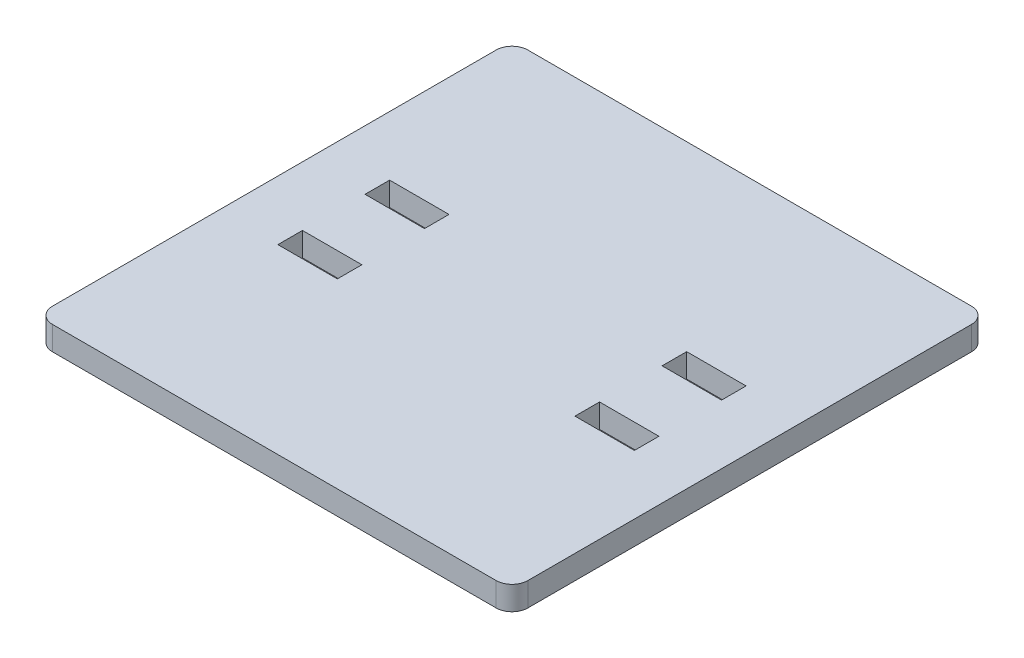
ISO-10303-21;
HEADER;
FILE_DESCRIPTION(('STEP AP214'),'2;1');
FILE_NAME('part.step','',(''),(''),'','','');
FILE_SCHEMA(('AUTOMOTIVE_DESIGN { 1 0 10303 214 1 1 1 1 }'));
ENDSEC;
DATA;
#1=APPLICATION_CONTEXT('core data for automotive mechanical design processes');
#2=APPLICATION_PROTOCOL_DEFINITION('international standard','automotive_design',2000,#1);
#3=PRODUCT_CONTEXT('',#1,'mechanical');
#4=PRODUCT('Part','Part','',(#3));
#5=PRODUCT_RELATED_PRODUCT_CATEGORY('part','',(#4));
#6=PRODUCT_DEFINITION_FORMATION('','',#4);
#7=PRODUCT_DEFINITION_CONTEXT('part definition',#1,'design');
#8=PRODUCT_DEFINITION('design','',#6,#7);
#9=PRODUCT_DEFINITION_SHAPE('','',#8);
#10=(LENGTH_UNIT() NAMED_UNIT(*) SI_UNIT(.MILLI.,.METRE.));
#11=(NAMED_UNIT(*) PLANE_ANGLE_UNIT() SI_UNIT($,.RADIAN.));
#12=(NAMED_UNIT(*) SI_UNIT($,.STERADIAN.) SOLID_ANGLE_UNIT());
#13=UNCERTAINTY_MEASURE_WITH_UNIT(LENGTH_MEASURE(1.E-05),#10,'distance_accuracy_value','');
#14=(GEOMETRIC_REPRESENTATION_CONTEXT(3) GLOBAL_UNCERTAINTY_ASSIGNED_CONTEXT((#13)) GLOBAL_UNIT_ASSIGNED_CONTEXT((#10,
#11,#12)) REPRESENTATION_CONTEXT('',''));
#15=CARTESIAN_POINT('',(0.,0.,0.));
#16=DIRECTION('',(0.,0.,1.));
#17=DIRECTION('',(1.,0.,0.));
#18=AXIS2_PLACEMENT_3D('',#15,#16,#17);
#19=CARTESIAN_POINT('',(-60.,6.,60.));
#20=DIRECTION('',(1.,0.,0.));
#21=DIRECTION('',(0.,0.,-1.));
#22=AXIS2_PLACEMENT_3D('',#19,#20,#21);
#23=PLANE('',#22);
#24=DIRECTION('',(0.,0.,1.));
#25=VECTOR('',#24,1.);
#26=CARTESIAN_POINT('',(-60.,6.,60.));
#27=LINE('',#26,#25);
#28=CARTESIAN_POINT('',(-60.,6.,-56.));
#29=VERTEX_POINT('',#28);
#30=CARTESIAN_POINT('',(-60.,6.,56.));
#31=VERTEX_POINT('',#30);
#32=EDGE_CURVE('E331',#29,#31,#27,.T.);
#33=ORIENTED_EDGE('',*,*,#32,.F.);
#34=DIRECTION('',(0.,-1.,0.));
#35=VECTOR('',#34,1.);
#36=CARTESIAN_POINT('',(-60.,6.,-56.));
#37=LINE('',#36,#35);
#38=CARTESIAN_POINT('',(-60.,0.,-56.));
#39=VERTEX_POINT('',#38);
#40=EDGE_CURVE('E356',#29,#39,#37,.T.);
#41=ORIENTED_EDGE('',*,*,#40,.T.);
#42=DIRECTION('',(0.,0.,1.));
#43=VECTOR('',#42,1.);
#44=CARTESIAN_POINT('',(-60.,0.,60.));
#45=LINE('',#44,#43);
#46=CARTESIAN_POINT('',(-60.,0.,56.));
#47=VERTEX_POINT('',#46);
#48=EDGE_CURVE('E330',#39,#47,#45,.T.);
#49=ORIENTED_EDGE('',*,*,#48,.T.);
#50=DIRECTION('',(0.,-1.,0.));
#51=VECTOR('',#50,1.);
#52=CARTESIAN_POINT('',(-60.,6.,56.));
#53=LINE('',#52,#51);
#54=EDGE_CURVE('E344',#47,#31,#53,.F.);
#55=ORIENTED_EDGE('',*,*,#54,.T.);
#56=EDGE_LOOP('',(#33,#41,#49,#55));
#57=FACE_BOUND('',#56,.T.);
#58=ADVANCED_FACE('F34',(#57),#23,.F.);
#59=CARTESIAN_POINT('',(-60.,6.,60.));
#60=DIRECTION('',(0.,0.,-1.));
#61=DIRECTION('',(-1.,0.,0.));
#62=AXIS2_PLACEMENT_3D('',#59,#60,#61);
#63=PLANE('',#62);
#64=DIRECTION('',(1.,0.,0.));
#65=VECTOR('',#64,1.);
#66=CARTESIAN_POINT('',(-60.,0.,60.));
#67=LINE('',#66,#65);
#68=CARTESIAN_POINT('',(-56.,0.,60.));
#69=VERTEX_POINT('',#68);
#70=CARTESIAN_POINT('',(56.,0.,60.));
#71=VERTEX_POINT('',#70);
#72=EDGE_CURVE('E347',#69,#71,#67,.T.);
#73=ORIENTED_EDGE('',*,*,#72,.T.);
#74=DIRECTION('',(0.,-1.,0.));
#75=VECTOR('',#74,1.);
#76=CARTESIAN_POINT('',(56.,6.,60.));
#77=LINE('',#76,#75);
#78=CARTESIAN_POINT('',(56.,6.,60.));
#79=VERTEX_POINT('',#78);
#80=EDGE_CURVE('E11',#71,#79,#77,.F.);
#81=ORIENTED_EDGE('',*,*,#80,.T.);
#82=DIRECTION('',(1.,0.,0.));
#83=VECTOR('',#82,1.);
#84=CARTESIAN_POINT('',(-60.,6.,60.));
#85=LINE('',#84,#83);
#86=CARTESIAN_POINT('',(-56.,6.,60.));
#87=VERTEX_POINT('',#86);
#88=EDGE_CURVE('E334',#87,#79,#85,.T.);
#89=ORIENTED_EDGE('',*,*,#88,.F.);
#90=DIRECTION('',(0.,-1.,0.));
#91=VECTOR('',#90,1.);
#92=CARTESIAN_POINT('',(-56.,6.,60.));
#93=LINE('',#92,#91);
#94=EDGE_CURVE('E42',#87,#69,#93,.T.);
#95=ORIENTED_EDGE('',*,*,#94,.T.);
#96=EDGE_LOOP('',(#73,#81,#89,#95));
#97=FACE_BOUND('',#96,.T.);
#98=ADVANCED_FACE('F389',(#97),#63,.F.);
#99=CARTESIAN_POINT('',(60.,6.,60.));
#100=DIRECTION('',(-1.,0.,0.));
#101=DIRECTION('',(0.,0.,1.));
#102=AXIS2_PLACEMENT_3D('',#99,#100,#101);
#103=PLANE('',#102);
#104=DIRECTION('',(0.,0.,-1.));
#105=VECTOR('',#104,1.);
#106=CARTESIAN_POINT('',(60.,0.,60.));
#107=LINE('',#106,#105);
#108=CARTESIAN_POINT('',(60.,0.,56.));
#109=VERTEX_POINT('',#108);
#110=CARTESIAN_POINT('',(60.,0.,-56.));
#111=VERTEX_POINT('',#110);
#112=EDGE_CURVE('E350',#109,#111,#107,.T.);
#113=ORIENTED_EDGE('',*,*,#112,.T.);
#114=DIRECTION('',(0.,-1.,0.));
#115=VECTOR('',#114,1.);
#116=CARTESIAN_POINT('',(60.,6.,-56.));
#117=LINE('',#116,#115);
#118=CARTESIAN_POINT('',(60.,6.,-56.));
#119=VERTEX_POINT('',#118);
#120=EDGE_CURVE('E383',#111,#119,#117,.F.);
#121=ORIENTED_EDGE('',*,*,#120,.T.);
#122=DIRECTION('',(0.,0.,-1.));
#123=VECTOR('',#122,1.);
#124=CARTESIAN_POINT('',(60.,6.,60.));
#125=LINE('',#124,#123);
#126=CARTESIAN_POINT('',(60.,6.,56.));
#127=VERTEX_POINT('',#126);
#128=EDGE_CURVE('E338',#127,#119,#125,.T.);
#129=ORIENTED_EDGE('',*,*,#128,.F.);
#130=DIRECTION('',(0.,-1.,0.));
#131=VECTOR('',#130,1.);
#132=CARTESIAN_POINT('',(60.,6.,56.));
#133=LINE('',#132,#131);
#134=EDGE_CURVE('E380',#127,#109,#133,.T.);
#135=ORIENTED_EDGE('',*,*,#134,.T.);
#136=EDGE_LOOP('',(#113,#121,#129,#135));
#137=FACE_BOUND('',#136,.T.);
#138=ADVANCED_FACE('F402',(#137),#103,.F.);
#139=CARTESIAN_POINT('',(-60.,6.,-60.));
#140=DIRECTION('',(0.,0.,1.));
#141=DIRECTION('',(1.,0.,0.));
#142=AXIS2_PLACEMENT_3D('',#139,#140,#141);
#143=PLANE('',#142);
#144=DIRECTION('',(-1.,0.,0.));
#145=VECTOR('',#144,1.);
#146=CARTESIAN_POINT('',(-60.,0.,-60.));
#147=LINE('',#146,#145);
#148=CARTESIAN_POINT('',(56.,0.,-60.));
#149=VERTEX_POINT('',#148);
#150=CARTESIAN_POINT('',(-56.,0.,-60.));
#151=VERTEX_POINT('',#150);
#152=EDGE_CURVE('E335',#149,#151,#147,.T.);
#153=ORIENTED_EDGE('',*,*,#152,.T.);
#154=DIRECTION('',(0.,-1.,0.));
#155=VECTOR('',#154,1.);
#156=CARTESIAN_POINT('',(-56.,6.,-60.));
#157=LINE('',#156,#155);
#158=CARTESIAN_POINT('',(-56.,6.,-60.));
#159=VERTEX_POINT('',#158);
#160=EDGE_CURVE('E370',#151,#159,#157,.F.);
#161=ORIENTED_EDGE('',*,*,#160,.T.);
#162=DIRECTION('',(-1.,0.,0.));
#163=VECTOR('',#162,1.);
#164=CARTESIAN_POINT('',(-60.,6.,-60.));
#165=LINE('',#164,#163);
#166=CARTESIAN_POINT('',(56.,6.,-60.));
#167=VERTEX_POINT('',#166);
#168=EDGE_CURVE('E341',#167,#159,#165,.T.);
#169=ORIENTED_EDGE('',*,*,#168,.F.);
#170=DIRECTION('',(0.,-1.,0.));
#171=VECTOR('',#170,1.);
#172=CARTESIAN_POINT('',(56.,6.,-60.));
#173=LINE('',#172,#171);
#174=EDGE_CURVE('E367',#167,#149,#173,.T.);
#175=ORIENTED_EDGE('',*,*,#174,.T.);
#176=EDGE_LOOP('',(#153,#161,#169,#175));
#177=FACE_BOUND('',#176,.T.);
#178=ADVANCED_FACE('F413',(#177),#143,.F.);
#179=CARTESIAN_POINT('',(0.,6.,0.));
#180=DIRECTION('',(0.,-1.,0.));
#181=DIRECTION('',(0.,0.,-1.));
#182=AXIS2_PLACEMENT_3D('',#179,#180,#181);
#183=PLANE('',#182);
#184=DIRECTION('',(1.,0.,0.));
#185=VECTOR('',#184,1.);
#186=CARTESIAN_POINT('',(30.,6.,14.1));
#187=LINE('',#186,#185);
#188=CARTESIAN_POINT('',(30.,6.,14.1));
#189=VERTEX_POINT('',#188);
#190=CARTESIAN_POINT('',(45.,6.,14.1));
#191=VERTEX_POINT('',#190);
#192=EDGE_CURVE('E250',#189,#191,#187,.T.);
#193=ORIENTED_EDGE('',*,*,#192,.F.);
#194=DIRECTION('',(0.,0.,1.));
#195=VECTOR('',#194,1.);
#196=CARTESIAN_POINT('',(30.,6.,7.9));
#197=LINE('',#196,#195);
#198=CARTESIAN_POINT('',(30.,6.,7.9));
#199=VERTEX_POINT('',#198);
#200=EDGE_CURVE('E49',#199,#189,#197,.T.);
#201=ORIENTED_EDGE('',*,*,#200,.F.);
#202=DIRECTION('',(-1.,0.,0.));
#203=VECTOR('',#202,1.);
#204=CARTESIAN_POINT('',(45.,6.,7.9));
#205=LINE('',#204,#203);
#206=CARTESIAN_POINT('',(45.,6.,7.9));
#207=VERTEX_POINT('',#206);
#208=EDGE_CURVE('E256',#207,#199,#205,.T.);
#209=ORIENTED_EDGE('',*,*,#208,.F.);
#210=DIRECTION('',(0.,0.,-1.));
#211=VECTOR('',#210,1.);
#212=CARTESIAN_POINT('',(45.,6.,14.1));
#213=LINE('',#212,#211);
#214=EDGE_CURVE('E253',#191,#207,#213,.T.);
#215=ORIENTED_EDGE('',*,*,#214,.F.);
#216=EDGE_LOOP('',(#193,#201,#209,#215));
#217=FACE_BOUND('',#216,.T.);
#218=DIRECTION('',(1.,0.,0.));
#219=VECTOR('',#218,1.);
#220=CARTESIAN_POINT('',(-45.,6.,-7.9));
#221=LINE('',#220,#219);
#222=CARTESIAN_POINT('',(-45.,6.,-7.9));
#223=VERTEX_POINT('',#222);
#224=CARTESIAN_POINT('',(-30.,6.,-7.9));
#225=VERTEX_POINT('',#224);
#226=EDGE_CURVE('E280',#223,#225,#221,.T.);
#227=ORIENTED_EDGE('',*,*,#226,.F.);
#228=DIRECTION('',(0.,0.,1.));
#229=VECTOR('',#228,1.);
#230=CARTESIAN_POINT('',(-45.,6.,-14.1));
#231=LINE('',#230,#229);
#232=CARTESIAN_POINT('',(-45.,6.,-14.1));
#233=VERTEX_POINT('',#232);
#234=EDGE_CURVE('E57',#233,#223,#231,.T.);
#235=ORIENTED_EDGE('',*,*,#234,.F.);
#236=DIRECTION('',(-1.,0.,0.));
#237=VECTOR('',#236,1.);
#238=CARTESIAN_POINT('',(-30.,6.,-14.1));
#239=LINE('',#238,#237);
#240=CARTESIAN_POINT('',(-30.,6.,-14.1));
#241=VERTEX_POINT('',#240);
#242=EDGE_CURVE('E286',#241,#233,#239,.T.);
#243=ORIENTED_EDGE('',*,*,#242,.F.);
#244=DIRECTION('',(0.,0.,-1.));
#245=VECTOR('',#244,1.);
#246=CARTESIAN_POINT('',(-30.,6.,-7.9));
#247=LINE('',#246,#245);
#248=EDGE_CURVE('E283',#225,#241,#247,.T.);
#249=ORIENTED_EDGE('',*,*,#248,.F.);
#250=EDGE_LOOP('',(#227,#235,#243,#249));
#251=FACE_BOUND('',#250,.T.);
#252=DIRECTION('',(1.,0.,0.));
#253=VECTOR('',#252,1.);
#254=CARTESIAN_POINT('',(30.,6.,-7.9));
#255=LINE('',#254,#253);
#256=CARTESIAN_POINT('',(30.,6.,-7.9));
#257=VERTEX_POINT('',#256);
#258=CARTESIAN_POINT('',(45.,6.,-7.9));
#259=VERTEX_POINT('',#258);
#260=EDGE_CURVE('E223',#257,#259,#255,.T.);
#261=ORIENTED_EDGE('',*,*,#260,.F.);
#262=DIRECTION('',(0.,0.,1.));
#263=VECTOR('',#262,1.);
#264=CARTESIAN_POINT('',(30.,6.,-14.1));
#265=LINE('',#264,#263);
#266=CARTESIAN_POINT('',(30.,6.,-14.1));
#267=VERTEX_POINT('',#266);
#268=EDGE_CURVE('E215',#267,#257,#265,.T.);
#269=ORIENTED_EDGE('',*,*,#268,.F.);
#270=DIRECTION('',(-1.,0.,0.));
#271=VECTOR('',#270,1.);
#272=CARTESIAN_POINT('',(45.,6.,-14.1));
#273=LINE('',#272,#271);
#274=CARTESIAN_POINT('',(45.,6.,-14.1));
#275=VERTEX_POINT('',#274);
#276=EDGE_CURVE('E216',#275,#267,#273,.T.);
#277=ORIENTED_EDGE('',*,*,#276,.F.);
#278=DIRECTION('',(0.,0.,-1.));
#279=VECTOR('',#278,1.);
#280=CARTESIAN_POINT('',(45.,6.,-7.9));
#281=LINE('',#280,#279);
#282=EDGE_CURVE('E230',#259,#275,#281,.T.);
#283=ORIENTED_EDGE('',*,*,#282,.F.);
#284=EDGE_LOOP('',(#261,#269,#277,#283));
#285=FACE_BOUND('',#284,.T.);
#286=DIRECTION('',(1.,0.,0.));
#287=VECTOR('',#286,1.);
#288=CARTESIAN_POINT('',(-45.,6.,14.1));
#289=LINE('',#288,#287);
#290=CARTESIAN_POINT('',(-45.,6.,14.1));
#291=VERTEX_POINT('',#290);
#292=CARTESIAN_POINT('',(-30.,6.,14.1));
#293=VERTEX_POINT('',#292);
#294=EDGE_CURVE('E309',#291,#293,#289,.T.);
#295=ORIENTED_EDGE('',*,*,#294,.F.);
#296=DIRECTION('',(0.,0.,1.));
#297=VECTOR('',#296,1.);
#298=CARTESIAN_POINT('',(-45.,6.,7.9));
#299=LINE('',#298,#297);
#300=CARTESIAN_POINT('',(-45.,6.,7.9));
#301=VERTEX_POINT('',#300);
#302=EDGE_CURVE('E307',#301,#291,#299,.T.);
#303=ORIENTED_EDGE('',*,*,#302,.F.);
#304=DIRECTION('',(-1.,0.,0.));
#305=VECTOR('',#304,1.);
#306=CARTESIAN_POINT('',(-30.,6.,7.9));
#307=LINE('',#306,#305);
#308=CARTESIAN_POINT('',(-30.,6.,7.9));
#309=VERTEX_POINT('',#308);
#310=EDGE_CURVE('E315',#309,#301,#307,.T.);
#311=ORIENTED_EDGE('',*,*,#310,.F.);
#312=DIRECTION('',(0.,0.,-1.));
#313=VECTOR('',#312,1.);
#314=CARTESIAN_POINT('',(-30.,6.,14.1));
#315=LINE('',#314,#313);
#316=EDGE_CURVE('E312',#293,#309,#315,.T.);
#317=ORIENTED_EDGE('',*,*,#316,.F.);
#318=EDGE_LOOP('',(#295,#303,#311,#317));
#319=FACE_BOUND('',#318,.T.);
#320=ORIENTED_EDGE('',*,*,#168,.T.);
#321=CARTESIAN_POINT('',(-56.,6.,-56.));
#322=DIRECTION('',(0.,-1.,0.));
#323=DIRECTION('',(0.,0.,-1.));
#324=AXIS2_PLACEMENT_3D('',#321,#322,#323);
#325=CIRCLE('',#324,4.);
#326=EDGE_CURVE('E378',#159,#29,#325,.F.);
#327=ORIENTED_EDGE('',*,*,#326,.T.);
#328=ORIENTED_EDGE('',*,*,#32,.T.);
#329=CARTESIAN_POINT('',(-56.,6.,56.));
#330=DIRECTION('',(0.,-1.,0.));
#331=DIRECTION('',(0.,0.,-1.));
#332=AXIS2_PLACEMENT_3D('',#329,#330,#331);
#333=CIRCLE('',#332,4.);
#334=EDGE_CURVE('E372',#31,#87,#333,.F.);
#335=ORIENTED_EDGE('',*,*,#334,.T.);
#336=ORIENTED_EDGE('',*,*,#88,.T.);
#337=CARTESIAN_POINT('',(56.,6.,56.));
#338=DIRECTION('',(0.,-1.,0.));
#339=DIRECTION('',(0.,0.,-1.));
#340=AXIS2_PLACEMENT_3D('',#337,#338,#339);
#341=CIRCLE('',#340,4.);
#342=EDGE_CURVE('E374',#79,#127,#341,.F.);
#343=ORIENTED_EDGE('',*,*,#342,.T.);
#344=ORIENTED_EDGE('',*,*,#128,.T.);
#345=CARTESIAN_POINT('',(56.,6.,-56.));
#346=DIRECTION('',(0.,-1.,0.));
#347=DIRECTION('',(0.,0.,-1.));
#348=AXIS2_PLACEMENT_3D('',#345,#346,#347);
#349=CIRCLE('',#348,4.);
#350=EDGE_CURVE('E376',#119,#167,#349,.F.);
#351=ORIENTED_EDGE('',*,*,#350,.T.);
#352=EDGE_LOOP('',(#320,#327,#328,#335,#336,#343,#344,#351));
#353=FACE_BOUND('',#352,.T.);
#354=ADVANCED_FACE('F406',(#217,#251,#285,#319,#353),#183,.F.);
#355=CARTESIAN_POINT('',(0.,0.,0.));
#356=DIRECTION('',(0.,-1.,0.));
#357=DIRECTION('',(0.,0.,-1.));
#358=AXIS2_PLACEMENT_3D('',#355,#356,#357);
#359=PLANE('',#358);
#360=DIRECTION('',(0.,0.,1.));
#361=VECTOR('',#360,1.);
#362=CARTESIAN_POINT('',(30.,0.,7.9));
#363=LINE('',#362,#361);
#364=CARTESIAN_POINT('',(30.,0.,7.9));
#365=VERTEX_POINT('',#364);
#366=CARTESIAN_POINT('',(30.,0.,14.1));
#367=VERTEX_POINT('',#366);
#368=EDGE_CURVE('E246',#365,#367,#363,.T.);
#369=ORIENTED_EDGE('',*,*,#368,.T.);
#370=DIRECTION('',(1.,0.,0.));
#371=VECTOR('',#370,1.);
#372=CARTESIAN_POINT('',(30.,0.,14.1));
#373=LINE('',#372,#371);
#374=CARTESIAN_POINT('',(45.,0.,14.1));
#375=VERTEX_POINT('',#374);
#376=EDGE_CURVE('E262',#367,#375,#373,.T.);
#377=ORIENTED_EDGE('',*,*,#376,.T.);
#378=DIRECTION('',(0.,0.,-1.));
#379=VECTOR('',#378,1.);
#380=CARTESIAN_POINT('',(45.,0.,14.1));
#381=LINE('',#380,#379);
#382=CARTESIAN_POINT('',(45.,0.,7.9));
#383=VERTEX_POINT('',#382);
#384=EDGE_CURVE('E239',#375,#383,#381,.T.);
#385=ORIENTED_EDGE('',*,*,#384,.T.);
#386=DIRECTION('',(-1.,0.,0.));
#387=VECTOR('',#386,1.);
#388=CARTESIAN_POINT('',(45.,0.,7.9));
#389=LINE('',#388,#387);
#390=EDGE_CURVE('E242',#383,#365,#389,.T.);
#391=ORIENTED_EDGE('',*,*,#390,.T.);
#392=EDGE_LOOP('',(#369,#377,#385,#391));
#393=FACE_BOUND('',#392,.T.);
#394=DIRECTION('',(0.,0.,1.));
#395=VECTOR('',#394,1.);
#396=CARTESIAN_POINT('',(-45.,0.,-14.1));
#397=LINE('',#396,#395);
#398=CARTESIAN_POINT('',(-45.,0.,-14.1));
#399=VERTEX_POINT('',#398);
#400=CARTESIAN_POINT('',(-45.,0.,-7.9));
#401=VERTEX_POINT('',#400);
#402=EDGE_CURVE('E276',#399,#401,#397,.T.);
#403=ORIENTED_EDGE('',*,*,#402,.T.);
#404=DIRECTION('',(1.,0.,0.));
#405=VECTOR('',#404,1.);
#406=CARTESIAN_POINT('',(-45.,0.,-7.9));
#407=LINE('',#406,#405);
#408=CARTESIAN_POINT('',(-30.,0.,-7.9));
#409=VERTEX_POINT('',#408);
#410=EDGE_CURVE('E243',#401,#409,#407,.T.);
#411=ORIENTED_EDGE('',*,*,#410,.T.);
#412=DIRECTION('',(0.,0.,-1.));
#413=VECTOR('',#412,1.);
#414=CARTESIAN_POINT('',(-30.,0.,-7.9));
#415=LINE('',#414,#413);
#416=CARTESIAN_POINT('',(-30.,0.,-14.1));
#417=VERTEX_POINT('',#416);
#418=EDGE_CURVE('E207',#409,#417,#415,.T.);
#419=ORIENTED_EDGE('',*,*,#418,.T.);
#420=DIRECTION('',(-1.,0.,0.));
#421=VECTOR('',#420,1.);
#422=CARTESIAN_POINT('',(-30.,0.,-14.1));
#423=LINE('',#422,#421);
#424=EDGE_CURVE('E273',#417,#399,#423,.T.);
#425=ORIENTED_EDGE('',*,*,#424,.T.);
#426=EDGE_LOOP('',(#403,#411,#419,#425));
#427=FACE_BOUND('',#426,.T.);
#428=DIRECTION('',(0.,0.,1.));
#429=VECTOR('',#428,1.);
#430=CARTESIAN_POINT('',(30.,0.,-14.1));
#431=LINE('',#430,#429);
#432=CARTESIAN_POINT('',(30.,0.,-14.1));
#433=VERTEX_POINT('',#432);
#434=CARTESIAN_POINT('',(30.,0.,-7.9));
#435=VERTEX_POINT('',#434);
#436=EDGE_CURVE('E212',#433,#435,#431,.T.);
#437=ORIENTED_EDGE('',*,*,#436,.T.);
#438=DIRECTION('',(1.,0.,0.));
#439=VECTOR('',#438,1.);
#440=CARTESIAN_POINT('',(30.,0.,-7.9));
#441=LINE('',#440,#439);
#442=CARTESIAN_POINT('',(45.,0.,-7.9));
#443=VERTEX_POINT('',#442);
#444=EDGE_CURVE('E196',#435,#443,#441,.T.);
#445=ORIENTED_EDGE('',*,*,#444,.T.);
#446=DIRECTION('',(0.,0.,-1.));
#447=VECTOR('',#446,1.);
#448=CARTESIAN_POINT('',(45.,0.,-7.9));
#449=LINE('',#448,#447);
#450=CARTESIAN_POINT('',(45.,0.,-14.1));
#451=VERTEX_POINT('',#450);
#452=EDGE_CURVE('E225',#443,#451,#449,.T.);
#453=ORIENTED_EDGE('',*,*,#452,.T.);
#454=DIRECTION('',(-1.,0.,0.));
#455=VECTOR('',#454,1.);
#456=CARTESIAN_POINT('',(45.,0.,-14.1));
#457=LINE('',#456,#455);
#458=EDGE_CURVE('E221',#451,#433,#457,.T.);
#459=ORIENTED_EDGE('',*,*,#458,.T.);
#460=EDGE_LOOP('',(#437,#445,#453,#459));
#461=FACE_BOUND('',#460,.T.);
#462=DIRECTION('',(0.,0.,1.));
#463=VECTOR('',#462,1.);
#464=CARTESIAN_POINT('',(-45.,0.,7.9));
#465=LINE('',#464,#463);
#466=CARTESIAN_POINT('',(-45.,0.,7.9));
#467=VERTEX_POINT('',#466);
#468=CARTESIAN_POINT('',(-45.,0.,14.1));
#469=VERTEX_POINT('',#468);
#470=EDGE_CURVE('E304',#467,#469,#465,.T.);
#471=ORIENTED_EDGE('',*,*,#470,.T.);
#472=DIRECTION('',(1.,0.,0.));
#473=VECTOR('',#472,1.);
#474=CARTESIAN_POINT('',(-45.,0.,14.1));
#475=LINE('',#474,#473);
#476=CARTESIAN_POINT('',(-30.,0.,14.1));
#477=VERTEX_POINT('',#476);
#478=EDGE_CURVE('E321',#469,#477,#475,.T.);
#479=ORIENTED_EDGE('',*,*,#478,.T.);
#480=DIRECTION('',(0.,0.,-1.));
#481=VECTOR('',#480,1.);
#482=CARTESIAN_POINT('',(-30.,0.,14.1));
#483=LINE('',#482,#481);
#484=CARTESIAN_POINT('',(-30.,0.,7.9));
#485=VERTEX_POINT('',#484);
#486=EDGE_CURVE('E270',#477,#485,#483,.T.);
#487=ORIENTED_EDGE('',*,*,#486,.T.);
#488=DIRECTION('',(-1.,0.,0.));
#489=VECTOR('',#488,1.);
#490=CARTESIAN_POINT('',(-30.,0.,7.9));
#491=LINE('',#490,#489);
#492=EDGE_CURVE('E301',#485,#467,#491,.T.);
#493=ORIENTED_EDGE('',*,*,#492,.T.);
#494=EDGE_LOOP('',(#471,#479,#487,#493));
#495=FACE_BOUND('',#494,.T.);
#496=ORIENTED_EDGE('',*,*,#48,.F.);
#497=CARTESIAN_POINT('',(-56.,0.,-56.));
#498=DIRECTION('',(0.,-1.,0.));
#499=DIRECTION('',(0.,0.,-1.));
#500=AXIS2_PLACEMENT_3D('',#497,#498,#499);
#501=CIRCLE('',#500,4.);
#502=EDGE_CURVE('E365',#39,#151,#501,.T.);
#503=ORIENTED_EDGE('',*,*,#502,.T.);
#504=ORIENTED_EDGE('',*,*,#152,.F.);
#505=CARTESIAN_POINT('',(56.,0.,-56.));
#506=DIRECTION('',(0.,-1.,0.));
#507=DIRECTION('',(0.,0.,-1.));
#508=AXIS2_PLACEMENT_3D('',#505,#506,#507);
#509=CIRCLE('',#508,4.);
#510=EDGE_CURVE('E363',#149,#111,#509,.T.);
#511=ORIENTED_EDGE('',*,*,#510,.T.);
#512=ORIENTED_EDGE('',*,*,#112,.F.);
#513=CARTESIAN_POINT('',(56.,0.,56.));
#514=DIRECTION('',(0.,-1.,0.));
#515=DIRECTION('',(0.,0.,-1.));
#516=AXIS2_PLACEMENT_3D('',#513,#514,#515);
#517=CIRCLE('',#516,4.);
#518=EDGE_CURVE('E361',#109,#71,#517,.T.);
#519=ORIENTED_EDGE('',*,*,#518,.T.);
#520=ORIENTED_EDGE('',*,*,#72,.F.);
#521=CARTESIAN_POINT('',(-56.,0.,56.));
#522=DIRECTION('',(0.,-1.,0.));
#523=DIRECTION('',(0.,0.,-1.));
#524=AXIS2_PLACEMENT_3D('',#521,#522,#523);
#525=CIRCLE('',#524,4.);
#526=EDGE_CURVE('E359',#69,#47,#525,.T.);
#527=ORIENTED_EDGE('',*,*,#526,.T.);
#528=EDGE_LOOP('',(#496,#503,#504,#511,#512,#519,#520,#527));
#529=FACE_BOUND('',#528,.T.);
#530=ADVANCED_FACE('F219',(#393,#427,#461,#495,#529),#359,.T.);
#531=CARTESIAN_POINT('',(-56.,6.,-56.));
#532=DIRECTION('',(0.,-1.,0.));
#533=DIRECTION('',(0.,0.,-1.));
#534=AXIS2_PLACEMENT_3D('',#531,#532,#533);
#535=CYLINDRICAL_SURFACE('',#534,4.);
#536=ORIENTED_EDGE('',*,*,#326,.F.);
#537=ORIENTED_EDGE('',*,*,#160,.F.);
#538=ORIENTED_EDGE('',*,*,#502,.F.);
#539=ORIENTED_EDGE('',*,*,#40,.F.);
#540=EDGE_LOOP('',(#536,#537,#538,#539));
#541=FACE_BOUND('',#540,.T.);
#542=ADVANCED_FACE('F418',(#541),#535,.T.);
#543=CARTESIAN_POINT('',(56.,6.,-56.));
#544=DIRECTION('',(0.,-1.,0.));
#545=DIRECTION('',(0.,0.,-1.));
#546=AXIS2_PLACEMENT_3D('',#543,#544,#545);
#547=CYLINDRICAL_SURFACE('',#546,4.);
#548=ORIENTED_EDGE('',*,*,#350,.F.);
#549=ORIENTED_EDGE('',*,*,#120,.F.);
#550=ORIENTED_EDGE('',*,*,#510,.F.);
#551=ORIENTED_EDGE('',*,*,#174,.F.);
#552=EDGE_LOOP('',(#548,#549,#550,#551));
#553=FACE_BOUND('',#552,.T.);
#554=ADVANCED_FACE('F410',(#553),#547,.T.);
#555=CARTESIAN_POINT('',(56.,6.,56.));
#556=DIRECTION('',(0.,-1.,0.));
#557=DIRECTION('',(0.,0.,-1.));
#558=AXIS2_PLACEMENT_3D('',#555,#556,#557);
#559=CYLINDRICAL_SURFACE('',#558,4.);
#560=ORIENTED_EDGE('',*,*,#342,.F.);
#561=ORIENTED_EDGE('',*,*,#80,.F.);
#562=ORIENTED_EDGE('',*,*,#518,.F.);
#563=ORIENTED_EDGE('',*,*,#134,.F.);
#564=EDGE_LOOP('',(#560,#561,#562,#563));
#565=FACE_BOUND('',#564,.T.);
#566=ADVANCED_FACE('F399',(#565),#559,.T.);
#567=CARTESIAN_POINT('',(-56.,6.,56.));
#568=DIRECTION('',(0.,-1.,0.));
#569=DIRECTION('',(0.,0.,-1.));
#570=AXIS2_PLACEMENT_3D('',#567,#568,#569);
#571=CYLINDRICAL_SURFACE('',#570,4.);
#572=ORIENTED_EDGE('',*,*,#334,.F.);
#573=ORIENTED_EDGE('',*,*,#54,.F.);
#574=ORIENTED_EDGE('',*,*,#526,.F.);
#575=ORIENTED_EDGE('',*,*,#94,.F.);
#576=EDGE_LOOP('',(#572,#573,#574,#575));
#577=FACE_BOUND('',#576,.T.);
#578=ADVANCED_FACE('F36',(#577),#571,.T.);
#579=CARTESIAN_POINT('',(-45.,-0.00100000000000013,7.9));
#580=DIRECTION('',(-1.,0.,0.));
#581=DIRECTION('',(0.,0.,1.));
#582=AXIS2_PLACEMENT_3D('',#579,#580,#581);
#583=PLANE('',#582);
#584=DIRECTION('',(0.,1.,0.));
#585=VECTOR('',#584,1.);
#586=CARTESIAN_POINT('',(-45.,-0.00100000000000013,7.9));
#587=LINE('',#586,#585);
#588=EDGE_CURVE('E319',#467,#301,#587,.T.);
#589=ORIENTED_EDGE('',*,*,#588,.T.);
#590=ORIENTED_EDGE('',*,*,#302,.T.);
#591=DIRECTION('',(0.,1.,0.));
#592=VECTOR('',#591,1.);
#593=CARTESIAN_POINT('',(-45.,-0.00100000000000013,14.1));
#594=LINE('',#593,#592);
#595=EDGE_CURVE('E318',#469,#291,#594,.T.);
#596=ORIENTED_EDGE('',*,*,#595,.F.);
#597=ORIENTED_EDGE('',*,*,#470,.F.);
#598=EDGE_LOOP('',(#589,#590,#596,#597));
#599=FACE_BOUND('',#598,.T.);
#600=ADVANCED_FACE('F423',(#599),#583,.F.);
#601=CARTESIAN_POINT('',(-30.,-0.00100000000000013,7.9));
#602=DIRECTION('',(0.,0.,-1.));
#603=DIRECTION('',(-1.,0.,0.));
#604=AXIS2_PLACEMENT_3D('',#601,#602,#603);
#605=PLANE('',#604);
#606=DIRECTION('',(0.,1.,0.));
#607=VECTOR('',#606,1.);
#608=CARTESIAN_POINT('',(-30.,-0.00100000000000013,7.9));
#609=LINE('',#608,#607);
#610=EDGE_CURVE('E322',#485,#309,#609,.T.);
#611=ORIENTED_EDGE('',*,*,#610,.T.);
#612=ORIENTED_EDGE('',*,*,#310,.T.);
#613=ORIENTED_EDGE('',*,*,#588,.F.);
#614=ORIENTED_EDGE('',*,*,#492,.F.);
#615=EDGE_LOOP('',(#611,#612,#613,#614));
#616=FACE_BOUND('',#615,.T.);
#617=ADVANCED_FACE('F428',(#616),#605,.F.);
#618=CARTESIAN_POINT('',(-30.,-0.00100000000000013,14.1));
#619=DIRECTION('',(1.,0.,0.));
#620=DIRECTION('',(0.,0.,-1.));
#621=AXIS2_PLACEMENT_3D('',#618,#619,#620);
#622=PLANE('',#621);
#623=DIRECTION('',(0.,1.,0.));
#624=VECTOR('',#623,1.);
#625=CARTESIAN_POINT('',(-30.,-0.00100000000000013,14.1));
#626=LINE('',#625,#624);
#627=EDGE_CURVE('E324',#477,#293,#626,.T.);
#628=ORIENTED_EDGE('',*,*,#627,.T.);
#629=ORIENTED_EDGE('',*,*,#316,.T.);
#630=ORIENTED_EDGE('',*,*,#610,.F.);
#631=ORIENTED_EDGE('',*,*,#486,.F.);
#632=EDGE_LOOP('',(#628,#629,#630,#631));
#633=FACE_BOUND('',#632,.T.);
#634=ADVANCED_FACE('F490',(#633),#622,.F.);
#635=CARTESIAN_POINT('',(-45.,-0.00100000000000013,14.1));
#636=DIRECTION('',(0.,0.,1.));
#637=DIRECTION('',(1.,0.,0.));
#638=AXIS2_PLACEMENT_3D('',#635,#636,#637);
#639=PLANE('',#638);
#640=ORIENTED_EDGE('',*,*,#595,.T.);
#641=ORIENTED_EDGE('',*,*,#294,.T.);
#642=ORIENTED_EDGE('',*,*,#627,.F.);
#643=ORIENTED_EDGE('',*,*,#478,.F.);
#644=EDGE_LOOP('',(#640,#641,#642,#643));
#645=FACE_BOUND('',#644,.T.);
#646=ADVANCED_FACE('F500',(#645),#639,.F.);
#647=CARTESIAN_POINT('',(30.,-0.00100000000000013,-14.1));
#648=DIRECTION('',(-1.,0.,0.));
#649=DIRECTION('',(0.,0.,1.));
#650=AXIS2_PLACEMENT_3D('',#647,#648,#649);
#651=PLANE('',#650);
#652=DIRECTION('',(0.,1.,0.));
#653=VECTOR('',#652,1.);
#654=CARTESIAN_POINT('',(30.,-0.00100000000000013,-14.1));
#655=LINE('',#654,#653);
#656=EDGE_CURVE('E208',#433,#267,#655,.T.);
#657=ORIENTED_EDGE('',*,*,#656,.T.);
#658=ORIENTED_EDGE('',*,*,#268,.T.);
#659=DIRECTION('',(0.,1.,0.));
#660=VECTOR('',#659,1.);
#661=CARTESIAN_POINT('',(30.,-0.00100000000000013,-7.9));
#662=LINE('',#661,#660);
#663=EDGE_CURVE('E200',#435,#257,#662,.T.);
#664=ORIENTED_EDGE('',*,*,#663,.F.);
#665=ORIENTED_EDGE('',*,*,#436,.F.);
#666=EDGE_LOOP('',(#657,#658,#664,#665));
#667=FACE_BOUND('',#666,.T.);
#668=ADVANCED_FACE('F211',(#667),#651,.F.);
#669=CARTESIAN_POINT('',(45.,-0.00100000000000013,-14.1));
#670=DIRECTION('',(0.,0.,-1.));
#671=DIRECTION('',(-1.,0.,0.));
#672=AXIS2_PLACEMENT_3D('',#669,#670,#671);
#673=PLANE('',#672);
#674=DIRECTION('',(0.,1.,0.));
#675=VECTOR('',#674,1.);
#676=CARTESIAN_POINT('',(45.,-0.00100000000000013,-14.1));
#677=LINE('',#676,#675);
#678=EDGE_CURVE('E236',#451,#275,#677,.T.);
#679=ORIENTED_EDGE('',*,*,#678,.T.);
#680=ORIENTED_EDGE('',*,*,#276,.T.);
#681=ORIENTED_EDGE('',*,*,#656,.F.);
#682=ORIENTED_EDGE('',*,*,#458,.F.);
#683=EDGE_LOOP('',(#679,#680,#681,#682));
#684=FACE_BOUND('',#683,.T.);
#685=ADVANCED_FACE('F519',(#684),#673,.F.);
#686=CARTESIAN_POINT('',(45.,-0.00100000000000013,-7.9));
#687=DIRECTION('',(1.,0.,0.));
#688=DIRECTION('',(0.,0.,-1.));
#689=AXIS2_PLACEMENT_3D('',#686,#687,#688);
#690=PLANE('',#689);
#691=DIRECTION('',(0.,1.,0.));
#692=VECTOR('',#691,1.);
#693=CARTESIAN_POINT('',(45.,-0.00100000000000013,-7.9));
#694=LINE('',#693,#692);
#695=EDGE_CURVE('E202',#443,#259,#694,.T.);
#696=ORIENTED_EDGE('',*,*,#695,.T.);
#697=ORIENTED_EDGE('',*,*,#282,.T.);
#698=ORIENTED_EDGE('',*,*,#678,.F.);
#699=ORIENTED_EDGE('',*,*,#452,.F.);
#700=EDGE_LOOP('',(#696,#697,#698,#699));
#701=FACE_BOUND('',#700,.T.);
#702=ADVANCED_FACE('F528',(#701),#690,.F.);
#703=CARTESIAN_POINT('',(30.,-0.00100000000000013,-7.9));
#704=DIRECTION('',(0.,0.,1.));
#705=DIRECTION('',(1.,0.,0.));
#706=AXIS2_PLACEMENT_3D('',#703,#704,#705);
#707=PLANE('',#706);
#708=ORIENTED_EDGE('',*,*,#663,.T.);
#709=ORIENTED_EDGE('',*,*,#260,.T.);
#710=ORIENTED_EDGE('',*,*,#695,.F.);
#711=ORIENTED_EDGE('',*,*,#444,.F.);
#712=EDGE_LOOP('',(#708,#709,#710,#711));
#713=FACE_BOUND('',#712,.T.);
#714=ADVANCED_FACE('F198',(#713),#707,.F.);
#715=CARTESIAN_POINT('',(-45.,-0.00100000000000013,-14.1));
#716=DIRECTION('',(-1.,0.,0.));
#717=DIRECTION('',(0.,0.,1.));
#718=AXIS2_PLACEMENT_3D('',#715,#716,#717);
#719=PLANE('',#718);
#720=DIRECTION('',(0.,1.,0.));
#721=VECTOR('',#720,1.);
#722=CARTESIAN_POINT('',(-45.,-0.00100000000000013,-14.1));
#723=LINE('',#722,#721);
#724=EDGE_CURVE('E290',#399,#233,#723,.T.);
#725=ORIENTED_EDGE('',*,*,#724,.T.);
#726=ORIENTED_EDGE('',*,*,#234,.T.);
#727=DIRECTION('',(0.,1.,0.));
#728=VECTOR('',#727,1.);
#729=CARTESIAN_POINT('',(-45.,-0.00100000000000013,-7.9));
#730=LINE('',#729,#728);
#731=EDGE_CURVE('E289',#401,#223,#730,.T.);
#732=ORIENTED_EDGE('',*,*,#731,.F.);
#733=ORIENTED_EDGE('',*,*,#402,.F.);
#734=EDGE_LOOP('',(#725,#726,#732,#733));
#735=FACE_BOUND('',#734,.T.);
#736=ADVANCED_FACE('F547',(#735),#719,.F.);
#737=CARTESIAN_POINT('',(-30.,-0.00100000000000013,-14.1));
#738=DIRECTION('',(0.,0.,-1.));
#739=DIRECTION('',(-1.,0.,0.));
#740=AXIS2_PLACEMENT_3D('',#737,#738,#739);
#741=PLANE('',#740);
#742=DIRECTION('',(0.,1.,0.));
#743=VECTOR('',#742,1.);
#744=CARTESIAN_POINT('',(-30.,-0.00100000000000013,-14.1));
#745=LINE('',#744,#743);
#746=EDGE_CURVE('E292',#417,#241,#745,.T.);
#747=ORIENTED_EDGE('',*,*,#746,.T.);
#748=ORIENTED_EDGE('',*,*,#242,.T.);
#749=ORIENTED_EDGE('',*,*,#724,.F.);
#750=ORIENTED_EDGE('',*,*,#424,.F.);
#751=EDGE_LOOP('',(#747,#748,#749,#750));
#752=FACE_BOUND('',#751,.T.);
#753=ADVANCED_FACE('F556',(#752),#741,.F.);
#754=CARTESIAN_POINT('',(-30.,-0.00100000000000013,-7.9));
#755=DIRECTION('',(1.,0.,0.));
#756=DIRECTION('',(0.,0.,-1.));
#757=AXIS2_PLACEMENT_3D('',#754,#755,#756);
#758=PLANE('',#757);
#759=DIRECTION('',(0.,1.,0.));
#760=VECTOR('',#759,1.);
#761=CARTESIAN_POINT('',(-30.,-0.00100000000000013,-7.9));
#762=LINE('',#761,#760);
#763=EDGE_CURVE('E294',#409,#225,#762,.T.);
#764=ORIENTED_EDGE('',*,*,#763,.T.);
#765=ORIENTED_EDGE('',*,*,#248,.T.);
#766=ORIENTED_EDGE('',*,*,#746,.F.);
#767=ORIENTED_EDGE('',*,*,#418,.F.);
#768=EDGE_LOOP('',(#764,#765,#766,#767));
#769=FACE_BOUND('',#768,.T.);
#770=ADVANCED_FACE('F565',(#769),#758,.F.);
#771=CARTESIAN_POINT('',(-45.,-0.00100000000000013,-7.9));
#772=DIRECTION('',(0.,0.,1.));
#773=DIRECTION('',(1.,0.,0.));
#774=AXIS2_PLACEMENT_3D('',#771,#772,#773);
#775=PLANE('',#774);
#776=ORIENTED_EDGE('',*,*,#731,.T.);
#777=ORIENTED_EDGE('',*,*,#226,.T.);
#778=ORIENTED_EDGE('',*,*,#763,.F.);
#779=ORIENTED_EDGE('',*,*,#410,.F.);
#780=EDGE_LOOP('',(#776,#777,#778,#779));
#781=FACE_BOUND('',#780,.T.);
#782=ADVANCED_FACE('F575',(#781),#775,.F.);
#783=CARTESIAN_POINT('',(30.,-0.00100000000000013,7.9));
#784=DIRECTION('',(-1.,0.,0.));
#785=DIRECTION('',(0.,0.,1.));
#786=AXIS2_PLACEMENT_3D('',#783,#784,#785);
#787=PLANE('',#786);
#788=DIRECTION('',(0.,1.,0.));
#789=VECTOR('',#788,1.);
#790=CARTESIAN_POINT('',(30.,-0.00100000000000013,7.9));
#791=LINE('',#790,#789);
#792=EDGE_CURVE('E260',#365,#199,#791,.T.);
#793=ORIENTED_EDGE('',*,*,#792,.T.);
#794=ORIENTED_EDGE('',*,*,#200,.T.);
#795=DIRECTION('',(0.,1.,0.));
#796=VECTOR('',#795,1.);
#797=CARTESIAN_POINT('',(30.,-0.00100000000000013,14.1));
#798=LINE('',#797,#796);
#799=EDGE_CURVE('E259',#367,#189,#798,.T.);
#800=ORIENTED_EDGE('',*,*,#799,.F.);
#801=ORIENTED_EDGE('',*,*,#368,.F.);
#802=EDGE_LOOP('',(#793,#794,#800,#801));
#803=FACE_BOUND('',#802,.T.);
#804=ADVANCED_FACE('F585',(#803),#787,.F.);
#805=CARTESIAN_POINT('',(45.,-0.00100000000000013,7.9));
#806=DIRECTION('',(0.,0.,-1.));
#807=DIRECTION('',(-1.,0.,0.));
#808=AXIS2_PLACEMENT_3D('',#805,#806,#807);
#809=PLANE('',#808);
#810=DIRECTION('',(0.,1.,0.));
#811=VECTOR('',#810,1.);
#812=CARTESIAN_POINT('',(45.,-0.00100000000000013,7.9));
#813=LINE('',#812,#811);
#814=EDGE_CURVE('E263',#383,#207,#813,.T.);
#815=ORIENTED_EDGE('',*,*,#814,.T.);
#816=ORIENTED_EDGE('',*,*,#208,.T.);
#817=ORIENTED_EDGE('',*,*,#792,.F.);
#818=ORIENTED_EDGE('',*,*,#390,.F.);
#819=EDGE_LOOP('',(#815,#816,#817,#818));
#820=FACE_BOUND('',#819,.T.);
#821=ADVANCED_FACE('F595',(#820),#809,.F.);
#822=CARTESIAN_POINT('',(45.,-0.00100000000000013,14.1));
#823=DIRECTION('',(1.,0.,0.));
#824=DIRECTION('',(0.,0.,-1.));
#825=AXIS2_PLACEMENT_3D('',#822,#823,#824);
#826=PLANE('',#825);
#827=DIRECTION('',(0.,1.,0.));
#828=VECTOR('',#827,1.);
#829=CARTESIAN_POINT('',(45.,-0.00100000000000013,14.1));
#830=LINE('',#829,#828);
#831=EDGE_CURVE('E265',#375,#191,#830,.T.);
#832=ORIENTED_EDGE('',*,*,#831,.T.);
#833=ORIENTED_EDGE('',*,*,#214,.T.);
#834=ORIENTED_EDGE('',*,*,#814,.F.);
#835=ORIENTED_EDGE('',*,*,#384,.F.);
#836=EDGE_LOOP('',(#832,#833,#834,#835));
#837=FACE_BOUND('',#836,.T.);
#838=ADVANCED_FACE('F604',(#837),#826,.F.);
#839=CARTESIAN_POINT('',(30.,-0.00100000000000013,14.1));
#840=DIRECTION('',(0.,0.,1.));
#841=DIRECTION('',(1.,0.,0.));
#842=AXIS2_PLACEMENT_3D('',#839,#840,#841);
#843=PLANE('',#842);
#844=ORIENTED_EDGE('',*,*,#799,.T.);
#845=ORIENTED_EDGE('',*,*,#192,.T.);
#846=ORIENTED_EDGE('',*,*,#831,.F.);
#847=ORIENTED_EDGE('',*,*,#376,.F.);
#848=EDGE_LOOP('',(#844,#845,#846,#847));
#849=FACE_BOUND('',#848,.T.);
#850=ADVANCED_FACE('F614',(#849),#843,.F.);
#851=CLOSED_SHELL('',(#58,#98,#138,#178,#354,#530,#542,#554,#566,#578,#600,#617,#634,#646,#668,
#685,#702,#714,#736,#753,#770,#782,#804,#821,#838,#850));
#852=MANIFOLD_SOLID_BREP('B2',#851);
#853=ADVANCED_BREP_SHAPE_REPRESENTATION('',(#18,#852),#14);
#854=SHAPE_DEFINITION_REPRESENTATION(#9,#853);
ENDSEC;
END-ISO-10303-21;
